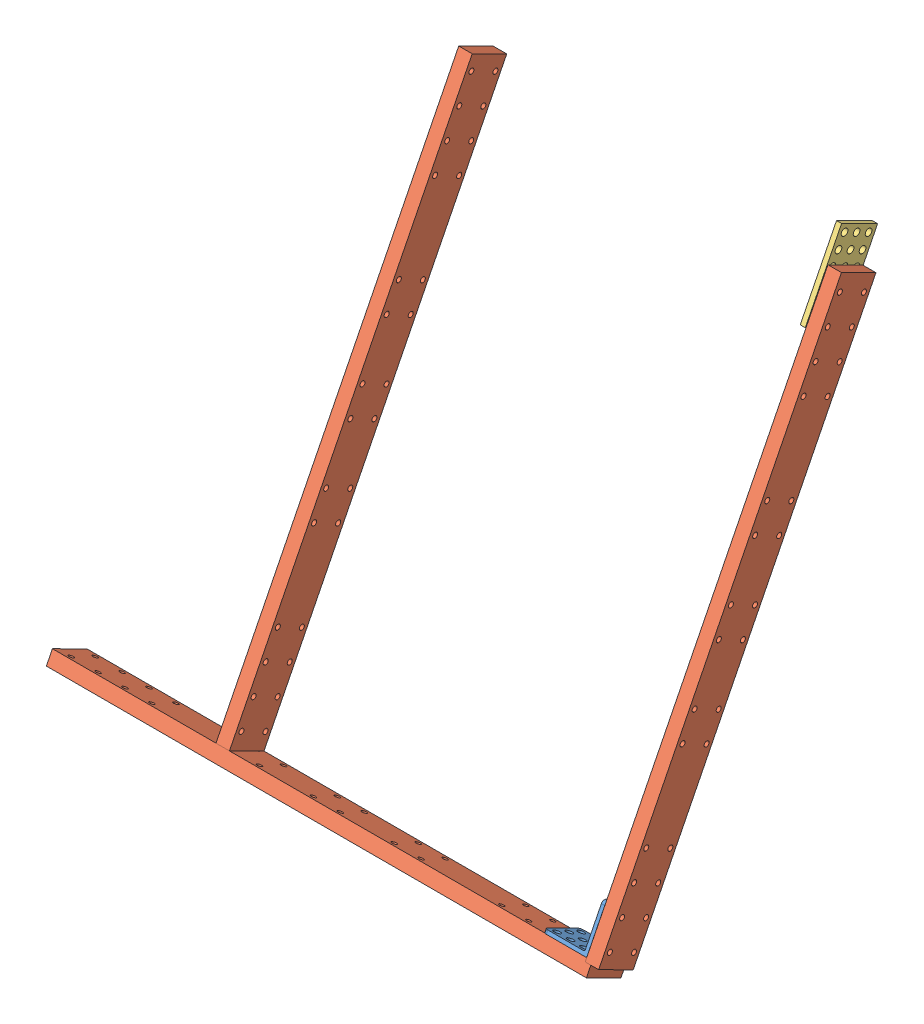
SolidWorks assembly 手终极夹子.SLDASM, configuration 默认 (file format 10000). Lengths in mm.
Overall size (326 319.84 176.13).
5 component instances, 3 part files, 11 mates.
Components (placement in the parent):
- 搞了半天的90度折角件-1: 搞了半天的90度折角件.SLDPRT [默认] at (130.5198 136.508 384.91) x (1 0 0) z (0 0.449524 0.893268) size (26 26 24)
- 手基本零件-1: 手基本零件.SLDPRT [默认] at (-139.1848 134.1442 398.0095) x (1 0 0) z (0 0.449524 0.893268) size (321 8 23)
- 手基本零件-2: 手基本零件.SLDPRT [默认] at (-64.2559 408.1138 260.1385) x (0 -0.893268 0.449524) z (0 0.449524 0.893268) size (321 8 23)
- 手基本零件-3: 手基本零件.SLDPRT [默认] at (164.5198 159.6204 385.6891) x (0 0.893268 -0.449524) z (0 0.449524 0.893268) size (321 8 23)
- 6x3-1: 6x3.SLDPRT [默认] at (156.5198 420.0851 254.9439) x (0 0.893268 -0.449524) z (0 0.449524 0.893268) size (48 3 24)
Mates (geometry in assembly coordinates):
- 重合3: coincident anti-aligned: plane of 手基本零件-1 through (-139.1848 141.2903 394.4133) normal (0 0.893268 -0.449524); plane of 手基本零件-2 through (-56.2559 136.7327 385.3566) normal (0 -0.893268 0.449524)
- 重合4: coincident anti-aligned: line of 手基本零件-1 through (-161.4802 147.0718 405.9018) axis (1 0 0); line of 手基本零件-2 through (-56.2559 147.0718 405.9018) axis (-1 0 0)
- 同心1: concentric aligned: circle of 搞了半天的90度折角件-1; circle of 手基本零件-3
- 平行2: parallel aligned: line of 搞了半天的90度折角件-1 through (156.5198 157.9464 374.1214) axis (0 -0.893268 0.449524); line of 手基本零件-3 through (156.5198 421.8862 242.3576) axis (0 -0.893268 0.449524)
- 重合8: coincident anti-aligned: plane of 搞了半天的90度折角件-1 through (156.5198 138.2945 384.0109) normal (1 0 0); plane of 手基本零件-3 through (156.5198 159.6204 385.6891) normal (-1 0 0)
- 重合10: coincident anti-aligned: plane of 搞了半天的90度折角件-1 through (130.5198 136.508 384.91) normal (0 -0.893268 0.449524); plane of 手基本零件-1 through (-139.1848 141.2903 394.4133) normal (0 0.893268 -0.449524)
- 同心2: concentric aligned: circle of 搞了半天的90度折角件-1; circle of 手基本零件-1
- 同心3: concentric aligned: circle of 手基本零件-3; circle of 6x3-1
- 同心4: concentric aligned: circle of 手基本零件-3; circle of 6x3-1
- 重合11: coincident anti-aligned: plane of 手基本零件-3 through (156.5198 159.6204 385.6891) normal (-1 0 0); plane of 6x3-1 through (156.5198 420.0851 254.9439) normal (1 0 0)
- 锁定1: lock: unknown of 手基本零件-1; unknown of 手基本零件-2
